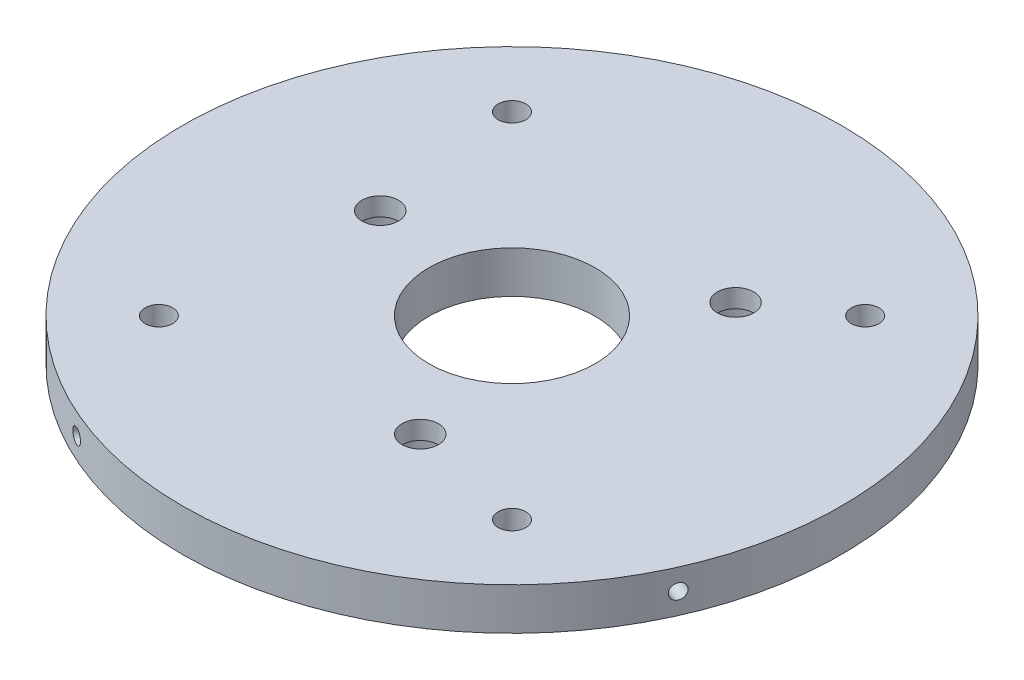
from build123d import *

# Parameters (mm, degrees)
SKETCH1_R                               = 49.7713
SKETCH1_R_2                             = 12.5603
BOSS_EXTRUDE1_DEPTH                     = 6.35
F_8_32_TAPPED_HOLE1_D                   = 4.1656
CBORE_FOR_M5_HEX_HEAD_BOLT1_D           = 5.5
CBORE_FOR_M5_HEX_HEAD_BOLT1_CBORE_D     = 12.24
CBORE_FOR_M5_HEX_HEAD_BOLT1_CBORE_DEPTH = 3.58
CIRPATTERN1_COUNT                       = 4


with BuildPart() as part:
    # Sketch1 → Boss-Extrude1 (new body)
    with BuildSketch(Plane(origin=(0, 0, 0), x_dir=(1, 0, 0), z_dir=(0, 1, 0))):
        with Locations(Location((0, 0, 0), (0, 0, 270))):
            Circle(SKETCH1_R)
        with Locations(Location((0, 0, 0), (0, 0, 270))):
            Circle(SKETCH1_R_2, mode=Mode.SUBTRACT)
    extrude(amount=BOSS_EXTRUDE1_DEPTH)

    # 8-32 Tapped Hole1 (through all)
    with Locations(Plane(origin=(0, 6.35, 0), x_dir=(1, 0, 0), z_dir=(0, 1, 0))):
        with Locations((-26.67, 26.67), (26.67, 26.67), (-26.67, -26.67), (26.67, -26.67)):
            Hole(F_8_32_TAPPED_HOLE1_D / 2)

    # CBORE for M5 Hex Head Bolt1 (through all)
    with Locations(Plane(origin=(0, 0, 0), x_dir=(-1, 0, 0), z_dir=(0, -1, 0))):
        with Locations((-15.138298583, 18.623423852), (-8.559208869, -22.42186307), (23.697507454, 3.798439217)):
            CounterBoreHole(CBORE_FOR_M5_HEX_HEAD_BOLT1_D / 2, CBORE_FOR_M5_HEX_HEAD_BOLT1_CBORE_D / 2, CBORE_FOR_M5_HEX_HEAD_BOLT1_CBORE_DEPTH)

    # Sketch6 → 4-40 Tapped Hole1 (revolve, cut)
    with BuildSketch(Plane(origin=(-20.331067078, 3.175, 45.429395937), x_dir=(0.9127628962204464, 0, 0.4084897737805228), z_dir=(0, 1, 0))):
        Polygon((0, 0), (0, 10.839152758), (1.1303, 10.16), (1.1303, 0), align=None)
    f_4_40_tapped_hole1 = revolve(axis=Axis((-22.924977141, 3.175, 51.225440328), (0.4084897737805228, 0, -0.9127628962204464)), mode=Mode.SUBTRACT)

    # CirPattern1: 4-40 Tapped Hole1 ×4 about axis
    cirpattern1_axis = Axis((0, 6.6675, 0), (0, -1, 0))
    for i in range(1, CIRPATTERN1_COUNT):
        add(f_4_40_tapped_hole1.rotate(cirpattern1_axis, i * 360 / CIRPATTERN1_COUNT), mode=Mode.SUBTRACT)


solid = part.part
